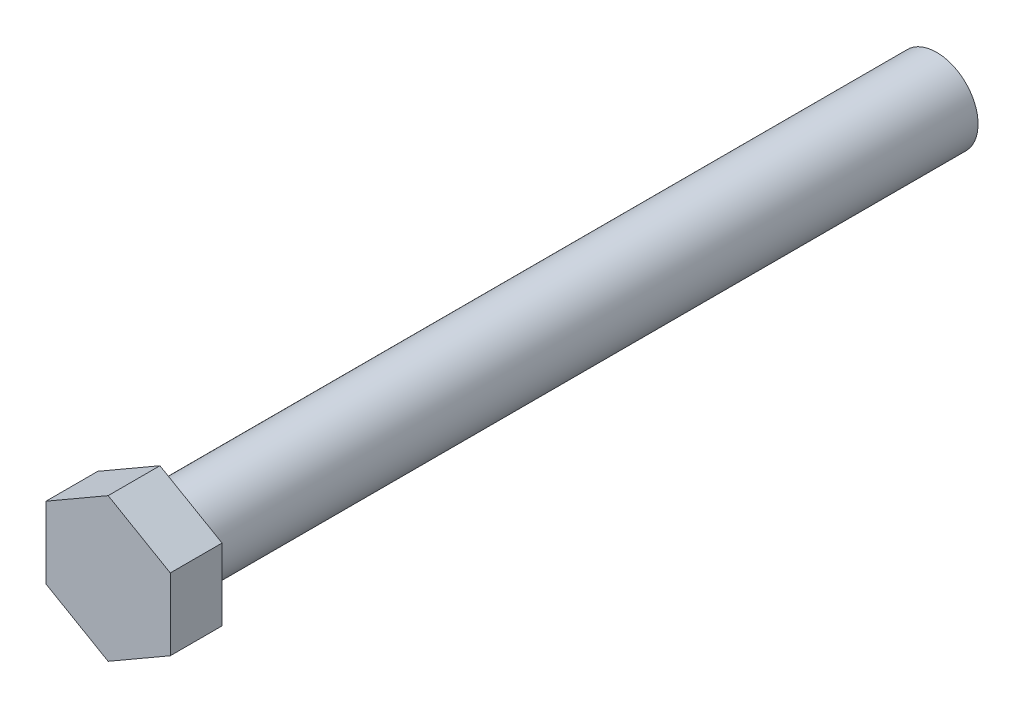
ISO-10303-21;
HEADER;
FILE_DESCRIPTION(('STEP AP214'),'2;1');
FILE_NAME('part.step','',(''),(''),'','','');
FILE_SCHEMA(('AUTOMOTIVE_DESIGN { 1 0 10303 214 1 1 1 1 }'));
ENDSEC;
DATA;
#1=APPLICATION_CONTEXT('core data for automotive mechanical design processes');
#2=APPLICATION_PROTOCOL_DEFINITION('international standard','automotive_design',2000,#1);
#3=PRODUCT_CONTEXT('',#1,'mechanical');
#4=PRODUCT('Part','Part','',(#3));
#5=PRODUCT_RELATED_PRODUCT_CATEGORY('part','',(#4));
#6=PRODUCT_DEFINITION_FORMATION('','',#4);
#7=PRODUCT_DEFINITION_CONTEXT('part definition',#1,'design');
#8=PRODUCT_DEFINITION('design','',#6,#7);
#9=PRODUCT_DEFINITION_SHAPE('','',#8);
#10=(LENGTH_UNIT() NAMED_UNIT(*) SI_UNIT(.MILLI.,.METRE.));
#11=(NAMED_UNIT(*) PLANE_ANGLE_UNIT() SI_UNIT($,.RADIAN.));
#12=(NAMED_UNIT(*) SI_UNIT($,.STERADIAN.) SOLID_ANGLE_UNIT());
#13=UNCERTAINTY_MEASURE_WITH_UNIT(LENGTH_MEASURE(1.E-05),#10,'distance_accuracy_value','');
#14=(GEOMETRIC_REPRESENTATION_CONTEXT(3) GLOBAL_UNCERTAINTY_ASSIGNED_CONTEXT((#13)) GLOBAL_UNIT_ASSIGNED_CONTEXT((#10,
#11,#12)) REPRESENTATION_CONTEXT('',''));
#15=CARTESIAN_POINT('',(0.,0.,0.));
#16=DIRECTION('',(0.,0.,1.));
#17=DIRECTION('',(1.,0.,0.));
#18=AXIS2_PLACEMENT_3D('',#15,#16,#17);
#19=CARTESIAN_POINT('',(0.,13.8564064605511,0.));
#20=DIRECTION('',(0.,0.,1.));
#21=DIRECTION('',(1.,0.,0.));
#22=AXIS2_PLACEMENT_3D('',#19,#20,#21);
#23=PLANE('',#22);
#24=DIRECTION('',(0.866025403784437,0.5,0.));
#25=VECTOR('',#24,1.);
#26=CARTESIAN_POINT('',(-12.,6.92820323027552,0.));
#27=LINE('',#26,#25);
#28=CARTESIAN_POINT('',(-12.,6.92820323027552,0.));
#29=VERTEX_POINT('',#28);
#30=CARTESIAN_POINT('',(0.,13.8564064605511,0.));
#31=VERTEX_POINT('',#30);
#32=EDGE_CURVE('E69',#29,#31,#27,.T.);
#33=ORIENTED_EDGE('',*,*,#32,.T.);
#34=DIRECTION('',(-0.866025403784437,0.5,0.));
#35=VECTOR('',#34,1.);
#36=CARTESIAN_POINT('',(12.,6.92820323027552,0.));
#37=LINE('',#36,#35);
#38=CARTESIAN_POINT('',(12.,6.92820323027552,0.));
#39=VERTEX_POINT('',#38);
#40=EDGE_CURVE('E83',#39,#31,#37,.T.);
#41=ORIENTED_EDGE('',*,*,#40,.F.);
#42=DIRECTION('',(0.,-1.,0.));
#43=VECTOR('',#42,1.);
#44=CARTESIAN_POINT('',(12.,6.92820323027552,0.));
#45=LINE('',#44,#43);
#46=CARTESIAN_POINT('',(12.,-6.92820323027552,0.));
#47=VERTEX_POINT('',#46);
#48=EDGE_CURVE('E90',#39,#47,#45,.T.);
#49=ORIENTED_EDGE('',*,*,#48,.T.);
#50=DIRECTION('',(-0.866025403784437,-0.5,0.));
#51=VECTOR('',#50,1.);
#52=CARTESIAN_POINT('',(12.,-6.92820323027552,0.));
#53=LINE('',#52,#51);
#54=CARTESIAN_POINT('',(0.,-13.8564064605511,0.));
#55=VERTEX_POINT('',#54);
#56=EDGE_CURVE('E92',#47,#55,#53,.T.);
#57=ORIENTED_EDGE('',*,*,#56,.T.);
#58=DIRECTION('',(0.866025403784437,-0.5,0.));
#59=VECTOR('',#58,1.);
#60=CARTESIAN_POINT('',(-12.,-6.92820323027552,0.));
#61=LINE('',#60,#59);
#62=CARTESIAN_POINT('',(-12.,-6.92820323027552,0.));
#63=VERTEX_POINT('',#62);
#64=EDGE_CURVE('E98',#63,#55,#61,.T.);
#65=ORIENTED_EDGE('',*,*,#64,.F.);
#66=DIRECTION('',(0.,-1.,0.));
#67=VECTOR('',#66,1.);
#68=CARTESIAN_POINT('',(-12.,6.92820323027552,0.));
#69=LINE('',#68,#67);
#70=EDGE_CURVE('E86',#29,#63,#69,.T.);
#71=ORIENTED_EDGE('',*,*,#70,.F.);
#72=EDGE_LOOP('',(#33,#41,#49,#57,#65,#71));
#73=FACE_BOUND('',#72,.T.);
#74=CARTESIAN_POINT('',(0.,0.,0.));
#75=DIRECTION('',(0.,0.,-1.));
#76=DIRECTION('',(-1.,0.,0.));
#77=AXIS2_PLACEMENT_3D('',#74,#75,#76);
#78=CIRCLE('',#77,8.);
#79=CARTESIAN_POINT('',(-8.,0.,0.));
#80=VERTEX_POINT('',#79);
#81=EDGE_CURVE('E9',#80,#80,#78,.T.);
#82=ORIENTED_EDGE('',*,*,#81,.F.);
#83=EDGE_LOOP('',(#82));
#84=FACE_BOUND('',#83,.T.);
#85=ADVANCED_FACE('F14',(#73,#84),#23,.F.);
#86=CARTESIAN_POINT('',(-12.,6.92820323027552,10.));
#87=DIRECTION('',(-0.5,0.866025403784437,0.));
#88=DIRECTION('',(-0.866025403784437,-0.5,0.));
#89=AXIS2_PLACEMENT_3D('',#86,#87,#88);
#90=PLANE('',#89);
#91=DIRECTION('',(0.,0.,-1.));
#92=VECTOR('',#91,1.);
#93=CARTESIAN_POINT('',(-12.,6.92820323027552,10.));
#94=LINE('',#93,#92);
#95=CARTESIAN_POINT('',(-12.,6.92820323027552,10.));
#96=VERTEX_POINT('',#95);
#97=EDGE_CURVE('E18',#96,#29,#94,.T.);
#98=ORIENTED_EDGE('',*,*,#97,.F.);
#99=DIRECTION('',(0.866025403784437,0.5,0.));
#100=VECTOR('',#99,1.);
#101=CARTESIAN_POINT('',(-12.,6.92820323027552,10.));
#102=LINE('',#101,#100);
#103=CARTESIAN_POINT('',(0.,13.8564064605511,10.));
#104=VERTEX_POINT('',#103);
#105=EDGE_CURVE('E71',#96,#104,#102,.T.);
#106=ORIENTED_EDGE('',*,*,#105,.T.);
#107=DIRECTION('',(0.,0.,-1.));
#108=VECTOR('',#107,1.);
#109=CARTESIAN_POINT('',(0.,13.8564064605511,10.));
#110=LINE('',#109,#108);
#111=EDGE_CURVE('E66',#104,#31,#110,.T.);
#112=ORIENTED_EDGE('',*,*,#111,.T.);
#113=ORIENTED_EDGE('',*,*,#32,.F.);
#114=EDGE_LOOP('',(#98,#106,#112,#113));
#115=FACE_BOUND('',#114,.T.);
#116=ADVANCED_FACE('F68',(#115),#90,.T.);
#117=CARTESIAN_POINT('',(-12.,6.92820323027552,10.));
#118=DIRECTION('',(1.,0.,0.));
#119=DIRECTION('',(0.,0.,-1.));
#120=AXIS2_PLACEMENT_3D('',#117,#118,#119);
#121=PLANE('',#120);
#122=DIRECTION('',(0.,0.,-1.));
#123=VECTOR('',#122,1.);
#124=CARTESIAN_POINT('',(-12.,-6.92820323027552,10.));
#125=LINE('',#124,#123);
#126=CARTESIAN_POINT('',(-12.,-6.92820323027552,10.));
#127=VERTEX_POINT('',#126);
#128=EDGE_CURVE('E37',#127,#63,#125,.T.);
#129=ORIENTED_EDGE('',*,*,#128,.F.);
#130=DIRECTION('',(0.,-1.,0.));
#131=VECTOR('',#130,1.);
#132=CARTESIAN_POINT('',(-12.,6.92820323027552,10.));
#133=LINE('',#132,#131);
#134=EDGE_CURVE('E77',#96,#127,#133,.T.);
#135=ORIENTED_EDGE('',*,*,#134,.F.);
#136=ORIENTED_EDGE('',*,*,#97,.T.);
#137=ORIENTED_EDGE('',*,*,#70,.T.);
#138=EDGE_LOOP('',(#129,#135,#136,#137));
#139=FACE_BOUND('',#138,.T.);
#140=ADVANCED_FACE('F16',(#139),#121,.F.);
#141=CARTESIAN_POINT('',(-12.,-6.92820323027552,10.));
#142=DIRECTION('',(0.5,0.866025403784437,0.));
#143=DIRECTION('',(-0.866025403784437,0.5,0.));
#144=AXIS2_PLACEMENT_3D('',#141,#142,#143);
#145=PLANE('',#144);
#146=DIRECTION('',(0.,0.,-1.));
#147=VECTOR('',#146,1.);
#148=CARTESIAN_POINT('',(0.,-13.8564064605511,10.));
#149=LINE('',#148,#147);
#150=CARTESIAN_POINT('',(0.,-13.8564064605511,10.));
#151=VERTEX_POINT('',#150);
#152=EDGE_CURVE('E119',#151,#55,#149,.T.);
#153=ORIENTED_EDGE('',*,*,#152,.F.);
#154=DIRECTION('',(0.866025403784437,-0.5,0.));
#155=VECTOR('',#154,1.);
#156=CARTESIAN_POINT('',(-12.,-6.92820323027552,10.));
#157=LINE('',#156,#155);
#158=EDGE_CURVE('E111',#127,#151,#157,.T.);
#159=ORIENTED_EDGE('',*,*,#158,.F.);
#160=ORIENTED_EDGE('',*,*,#128,.T.);
#161=ORIENTED_EDGE('',*,*,#64,.T.);
#162=EDGE_LOOP('',(#153,#159,#160,#161));
#163=FACE_BOUND('',#162,.T.);
#164=ADVANCED_FACE('F130',(#163),#145,.F.);
#165=CARTESIAN_POINT('',(12.,-6.92820323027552,10.));
#166=DIRECTION('',(0.5,-0.866025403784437,0.));
#167=DIRECTION('',(0.866025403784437,0.5,0.));
#168=AXIS2_PLACEMENT_3D('',#165,#166,#167);
#169=PLANE('',#168);
#170=DIRECTION('',(0.,0.,-1.));
#171=VECTOR('',#170,1.);
#172=CARTESIAN_POINT('',(12.,-6.92820323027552,10.));
#173=LINE('',#172,#171);
#174=CARTESIAN_POINT('',(12.,-6.92820323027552,10.));
#175=VERTEX_POINT('',#174);
#176=EDGE_CURVE('E117',#175,#47,#173,.T.);
#177=ORIENTED_EDGE('',*,*,#176,.F.);
#178=DIRECTION('',(-0.866025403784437,-0.5,0.));
#179=VECTOR('',#178,1.);
#180=CARTESIAN_POINT('',(12.,-6.92820323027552,10.));
#181=LINE('',#180,#179);
#182=EDGE_CURVE('E108',#175,#151,#181,.T.);
#183=ORIENTED_EDGE('',*,*,#182,.T.);
#184=ORIENTED_EDGE('',*,*,#152,.T.);
#185=ORIENTED_EDGE('',*,*,#56,.F.);
#186=EDGE_LOOP('',(#177,#183,#184,#185));
#187=FACE_BOUND('',#186,.T.);
#188=ADVANCED_FACE('F129',(#187),#169,.T.);
#189=CARTESIAN_POINT('',(12.,6.92820323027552,10.));
#190=DIRECTION('',(1.,0.,0.));
#191=DIRECTION('',(0.,0.,-1.));
#192=AXIS2_PLACEMENT_3D('',#189,#190,#191);
#193=PLANE('',#192);
#194=DIRECTION('',(0.,0.,-1.));
#195=VECTOR('',#194,1.);
#196=CARTESIAN_POINT('',(12.,6.92820323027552,10.));
#197=LINE('',#196,#195);
#198=CARTESIAN_POINT('',(12.,6.92820323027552,10.));
#199=VERTEX_POINT('',#198);
#200=EDGE_CURVE('E76',#199,#39,#197,.T.);
#201=ORIENTED_EDGE('',*,*,#200,.F.);
#202=DIRECTION('',(0.,-1.,0.));
#203=VECTOR('',#202,1.);
#204=CARTESIAN_POINT('',(12.,6.92820323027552,10.));
#205=LINE('',#204,#203);
#206=EDGE_CURVE('E105',#199,#175,#205,.T.);
#207=ORIENTED_EDGE('',*,*,#206,.T.);
#208=ORIENTED_EDGE('',*,*,#176,.T.);
#209=ORIENTED_EDGE('',*,*,#48,.F.);
#210=EDGE_LOOP('',(#201,#207,#208,#209));
#211=FACE_BOUND('',#210,.T.);
#212=ADVANCED_FACE('F126',(#211),#193,.T.);
#213=CARTESIAN_POINT('',(12.,6.92820323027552,10.));
#214=DIRECTION('',(-0.5,-0.866025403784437,0.));
#215=DIRECTION('',(0.866025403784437,-0.5,0.));
#216=AXIS2_PLACEMENT_3D('',#213,#214,#215);
#217=PLANE('',#216);
#218=DIRECTION('',(-0.866025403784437,0.5,0.));
#219=VECTOR('',#218,1.);
#220=CARTESIAN_POINT('',(12.,6.92820323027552,10.));
#221=LINE('',#220,#219);
#222=EDGE_CURVE('E103',#199,#104,#221,.T.);
#223=ORIENTED_EDGE('',*,*,#222,.F.);
#224=ORIENTED_EDGE('',*,*,#200,.T.);
#225=ORIENTED_EDGE('',*,*,#40,.T.);
#226=ORIENTED_EDGE('',*,*,#111,.F.);
#227=EDGE_LOOP('',(#223,#224,#225,#226));
#228=FACE_BOUND('',#227,.T.);
#229=ADVANCED_FACE('F89',(#228),#217,.F.);
#230=CARTESIAN_POINT('',(0.,13.8564064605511,10.));
#231=DIRECTION('',(0.,0.,1.));
#232=DIRECTION('',(1.,0.,0.));
#233=AXIS2_PLACEMENT_3D('',#230,#231,#232);
#234=PLANE('',#233);
#235=ORIENTED_EDGE('',*,*,#105,.F.);
#236=ORIENTED_EDGE('',*,*,#134,.T.);
#237=ORIENTED_EDGE('',*,*,#158,.T.);
#238=ORIENTED_EDGE('',*,*,#182,.F.);
#239=ORIENTED_EDGE('',*,*,#206,.F.);
#240=ORIENTED_EDGE('',*,*,#222,.T.);
#241=EDGE_LOOP('',(#235,#236,#237,#238,#239,#240));
#242=FACE_BOUND('',#241,.T.);
#243=ADVANCED_FACE('F122',(#242),#234,.T.);
#244=CARTESIAN_POINT('',(0.,0.,-150.));
#245=DIRECTION('',(0.,0.,1.));
#246=DIRECTION('',(1.,0.,0.));
#247=AXIS2_PLACEMENT_3D('',#244,#245,#246);
#248=CYLINDRICAL_SURFACE('',#247,8.);
#249=CARTESIAN_POINT('',(0.,0.,-150.));
#250=DIRECTION('',(0.,0.,-1.));
#251=DIRECTION('',(-1.,0.,0.));
#252=AXIS2_PLACEMENT_3D('',#249,#250,#251);
#253=CIRCLE('',#252,8.);
#254=CARTESIAN_POINT('',(-8.,0.,-150.));
#255=VERTEX_POINT('',#254);
#256=EDGE_CURVE('E87',#255,#255,#253,.T.);
#257=ORIENTED_EDGE('',*,*,#256,.F.);
#258=EDGE_LOOP('',(#257));
#259=FACE_BOUND('',#258,.T.);
#260=ORIENTED_EDGE('',*,*,#81,.T.);
#261=EDGE_LOOP('',(#260));
#262=FACE_BOUND('',#261,.T.);
#263=ADVANCED_FACE('F148',(#259,#262),#248,.T.);
#264=CARTESIAN_POINT('',(0.,0.,-150.));
#265=DIRECTION('',(0.,0.,-1.));
#266=DIRECTION('',(-1.,0.,0.));
#267=AXIS2_PLACEMENT_3D('',#264,#265,#266);
#268=PLANE('',#267);
#269=ORIENTED_EDGE('',*,*,#256,.T.);
#270=EDGE_LOOP('',(#269));
#271=FACE_BOUND('',#270,.T.);
#272=ADVANCED_FACE('F154',(#271),#268,.T.);
#273=CLOSED_SHELL('',(#85,#116,#140,#164,#188,#212,#229,#243,#263,#272));
#274=MANIFOLD_SOLID_BREP('B1',#273);
#275=ADVANCED_BREP_SHAPE_REPRESENTATION('',(#18,#274),#14);
#276=SHAPE_DEFINITION_REPRESENTATION(#9,#275);
ENDSEC;
END-ISO-10303-21;
